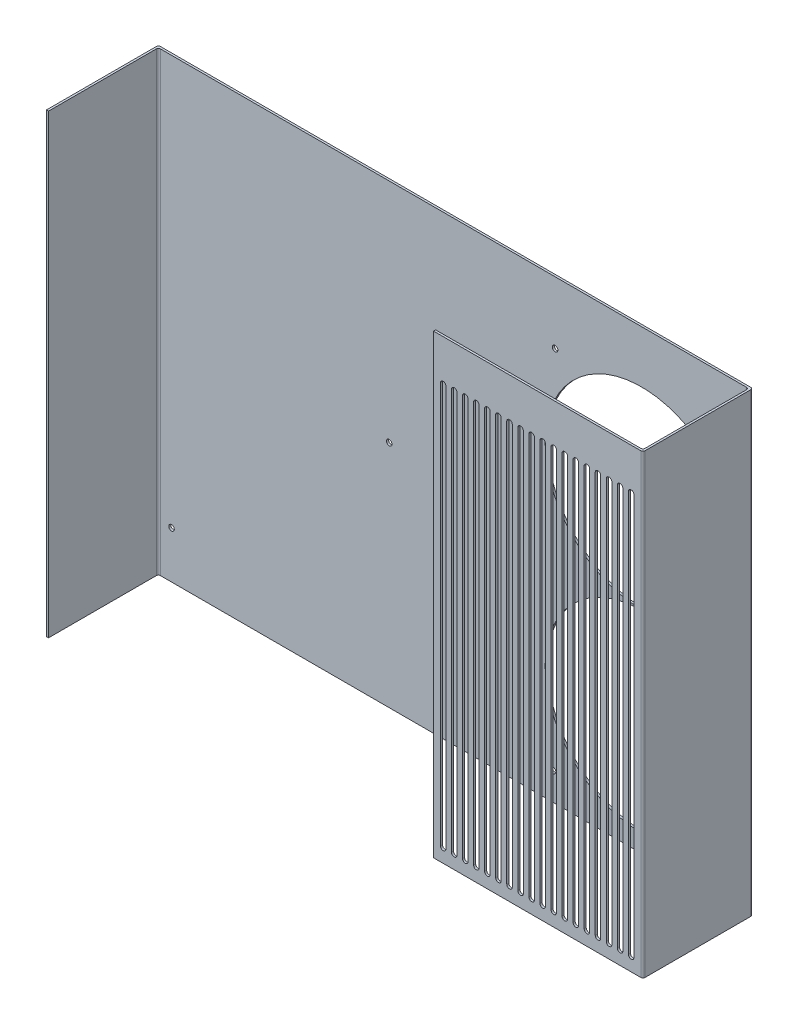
from build123d import *

# Parameters (mm, degrees)
ESQUISSE1_W             = 430
ESQUISSE1_H             = 330
BOSS_EXTRU_1_DEPTH      = 1.5
ESQUISSE2_W             = 1.5
ESQUISSE2_H             = 330
BOSS_EXTRU_2_DEPTH      = 79.5
ESQUISSE3_W             = 1.5
ESQUISSE3_H             = 330
BOSS_EXTRU_3_DEPTH      = 78
ESQUISSE4_W             = 1.5
ESQUISSE4_H             = 330
BOSS_EXTRU_4_DEPTH      = 150
CONG_1_R                = 1.5
ESQUISSE6_R             = 2
ENL_V_MAT_EXTRU_1_DEPTH = 3
ESQUISSE7_R             = 2
ESQUISSE7_R_2           = 69.75
ENL_V_MAT_EXTRU_2_DEPTH = 3
ENL_V_MAT_EXTRU_3_DEPTH = 3


with BuildPart() as part:
    # Esquisse1 → Boss.-Extru.1 (new body)
    with BuildSketch(Plane.XY):
        with Locations((-38.017202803, -7.151182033)):
            Rectangle(ESQUISSE1_W, ESQUISSE1_H)
    extrude(amount=BOSS_EXTRU_1_DEPTH)

    # Esquisse2 → Boss.-Extru.2 (add)
    with BuildSketch(Plane.XY.offset(1.5)):
        with Locations((-252.267202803, -7.151182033)):
            Rectangle(ESQUISSE2_W, ESQUISSE2_H)
    extrude(amount=BOSS_EXTRU_2_DEPTH)

    # Esquisse3 → Boss.-Extru.3 (add)
    with BuildSketch(Plane.XY.offset(1.5)):
        with Locations((176.232797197, -7.151182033)):
            Rectangle(ESQUISSE3_W, ESQUISSE3_H)
    extrude(amount=BOSS_EXTRU_3_DEPTH)

    # Esquisse4 → Boss.-Extru.4 (add)
    with BuildSketch(Plane.ZY.offset(-175.482797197)):
        with Locations((78.75, -7.151182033)):
            Rectangle(ESQUISSE4_W, ESQUISSE4_H)
    extrude(amount=BOSS_EXTRU_4_DEPTH)

    # Cong_1
    cong_1_edges = [part.edges().sort_by_distance(p)[0] for p in [
        (-251.517202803, -7.151182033, 1.5),
        (175.482797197, -7.151182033, 1.5),
        (176.982797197, -7.151182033, 79.5),
        (175.482797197, -7.151182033, 78),
        (176.982797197, -7.151182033, 0),
        (-253.017202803, -7.151182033, 0),
    ]]
    fillet(cong_1_edges, radius=CONG_1_R)

    # Esquisse6 → Enl_v. mat.-Extru.1 (cut)
    with BuildSketch(Plane.XY.offset(1.5)):
        with Locations((-242.017202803, -138.151182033)):
            Circle(ESQUISSE6_R)
        with Locations((-84.537202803, -6.071182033)):
            Circle(ESQUISSE6_R)
    extrude(amount=-ENL_V_MAT_EXTRU_1_DEPTH, mode=Mode.SUBTRACT)

    # Esquisse7 → Enl_v. mat.-Extru.2 (cut)
    with BuildSketch(Plane(origin=(0, 0, 0), x_dir=(-1, 0, 0), z_dir=(0, 0, -1))):
        with Locations((-160.482797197, -152.151182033)):
            Circle(ESQUISSE7_R)
        with Locations((-35.482797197, 112.848817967)):
            Circle(ESQUISSE7_R)
        with Locations((-160.482797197, 112.848817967)):
            Circle(ESQUISSE7_R)
        with Locations((-33.982821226, -152.146936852)):
            Circle(ESQUISSE7_R)
        with Locations((-97.982797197, 50.348817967)):
            Circle(ESQUISSE7_R_2)
        with Locations((-97.982797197, -89.646936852)):
            Circle(ESQUISSE7_R_2)
    extrude(amount=-ENL_V_MAT_EXTRU_2_DEPTH, mode=Mode.SUBTRACT)

    # Esquisse9 → Enl_v. mat.-Extru.3 (cut)
    with BuildSketch(Plane.XY.offset(79.5)):
        with BuildLine():
            Line((170.482797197, -162.151182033), (170.482797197, 127.848817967))
            ThreePointArc((170.482797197, 127.848817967), (168.482797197, 129.848817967), (166.482797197, 127.848817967))
            Line((166.482797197, 127.848817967), (166.482797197, -162.151182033))
            ThreePointArc((166.482797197, -162.151182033), (168.482797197, -164.151182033), (170.482797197, -162.151182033))
        make_face()
        with BuildLine():
            Line((162.482797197, -162.151182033), (162.482797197, 127.848817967))
            ThreePointArc((162.482797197, 127.848817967), (160.482797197, 129.848817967), (158.482797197, 127.848817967))
            Line((158.482797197, 127.848817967), (158.482797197, -162.151182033))
            ThreePointArc((158.482797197, -162.151182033), (160.482797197, -164.151182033), (162.482797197, -162.151182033))
        make_face()
        with BuildLine():
            Line((154.482797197, -162.151182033), (154.482797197, 127.848817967))
            ThreePointArc((154.482797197, 127.848817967), (152.482797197, 129.848817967), (150.482797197, 127.848817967))
            Line((150.482797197, 127.848817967), (150.482797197, -162.151182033))
            ThreePointArc((150.482797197, -162.151182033), (152.482797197, -164.151182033), (154.482797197, -162.151182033))
        make_face()
        with BuildLine():
            Line((146.482797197, -162.151182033), (146.482797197, 127.848817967))
            ThreePointArc((146.482797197, 127.848817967), (144.482797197, 129.848817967), (142.482797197, 127.848817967))
            Line((142.482797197, 127.848817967), (142.482797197, -162.151182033))
            ThreePointArc((142.482797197, -162.151182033), (144.482797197, -164.151182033), (146.482797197, -162.151182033))
        make_face()
        with BuildLine():
            Line((138.482797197, -162.151182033), (138.482797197, 127.848817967))
            ThreePointArc((138.482797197, 127.848817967), (136.482797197, 129.848817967), (134.482797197, 127.848817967))
            Line((134.482797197, 127.848817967), (134.482797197, -162.151182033))
            ThreePointArc((134.482797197, -162.151182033), (136.482797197, -164.151182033), (138.482797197, -162.151182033))
        make_face()
        with BuildLine():
            Line((130.482797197, -162.151182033), (130.482797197, 127.848817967))
            ThreePointArc((130.482797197, 127.848817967), (128.482797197, 129.848817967), (126.482797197, 127.848817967))
            Line((126.482797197, 127.848817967), (126.482797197, -162.151182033))
            ThreePointArc((126.482797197, -162.151182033), (128.482797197, -164.151182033), (130.482797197, -162.151182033))
        make_face()
        with BuildLine():
            Line((122.482797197, -162.151182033), (122.482797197, 127.848817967))
            ThreePointArc((122.482797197, 127.848817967), (120.482797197, 129.848817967), (118.482797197, 127.848817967))
            Line((118.482797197, 127.848817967), (118.482797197, -162.151182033))
            ThreePointArc((118.482797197, -162.151182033), (120.482797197, -164.151182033), (122.482797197, -162.151182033))
        make_face()
        with BuildLine():
            Line((114.482797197, -162.151182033), (114.482797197, 127.848817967))
            ThreePointArc((114.482797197, 127.848817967), (112.482797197, 129.848817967), (110.482797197, 127.848817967))
            Line((110.482797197, 127.848817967), (110.482797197, -162.151182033))
            ThreePointArc((110.482797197, -162.151182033), (112.482797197, -164.151182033), (114.482797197, -162.151182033))
        make_face()
        with BuildLine():
            Line((106.482797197, -162.151182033), (106.482797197, 127.848817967))
            ThreePointArc((106.482797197, 127.848817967), (104.482797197, 129.848817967), (102.482797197, 127.848817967))
            Line((102.482797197, 127.848817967), (102.482797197, -162.151182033))
            ThreePointArc((102.482797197, -162.151182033), (104.482797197, -164.151182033), (106.482797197, -162.151182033))
        make_face()
        with BuildLine():
            Line((98.482797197, -162.151182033), (98.482797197, 127.848817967))
            ThreePointArc((98.482797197, 127.848817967), (96.482797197, 129.848817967), (94.482797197, 127.848817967))
            Line((94.482797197, 127.848817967), (94.482797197, -162.151182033))
            ThreePointArc((94.482797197, -162.151182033), (96.482797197, -164.151182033), (98.482797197, -162.151182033))
        make_face()
        with BuildLine():
            Line((90.482797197, -162.151182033), (90.482797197, 127.848817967))
            ThreePointArc((90.482797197, 127.848817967), (88.482797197, 129.848817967), (86.482797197, 127.848817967))
            Line((86.482797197, 127.848817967), (86.482797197, -162.151182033))
            ThreePointArc((86.482797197, -162.151182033), (88.482797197, -164.151182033), (90.482797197, -162.151182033))
        make_face()
        with BuildLine():
            Line((82.482797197, -162.151182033), (82.482797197, 127.848817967))
            ThreePointArc((82.482797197, 127.848817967), (80.482797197, 129.848817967), (78.482797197, 127.848817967))
            Line((78.482797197, 127.848817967), (78.482797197, -162.151182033))
            ThreePointArc((78.482797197, -162.151182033), (80.482797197, -164.151182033), (82.482797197, -162.151182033))
        make_face()
        with BuildLine():
            Line((74.482797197, -162.151182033), (74.482797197, 127.848817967))
            ThreePointArc((74.482797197, 127.848817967), (72.482797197, 129.848817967), (70.482797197, 127.848817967))
            Line((70.482797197, 127.848817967), (70.482797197, -162.151182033))
            ThreePointArc((70.482797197, -162.151182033), (72.482797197, -164.151182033), (74.482797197, -162.151182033))
        make_face()
        with BuildLine():
            Line((66.482797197, -162.151182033), (66.482797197, 127.848817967))
            ThreePointArc((66.482797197, 127.848817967), (64.482797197, 129.848817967), (62.482797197, 127.848817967))
            Line((62.482797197, 127.848817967), (62.482797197, -162.151182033))
            ThreePointArc((62.482797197, -162.151182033), (64.482797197, -164.151182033), (66.482797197, -162.151182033))
        make_face()
        with BuildLine():
            Line((58.482797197, -162.151182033), (58.482797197, 127.848817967))
            ThreePointArc((58.482797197, 127.848817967), (56.482797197, 129.848817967), (54.482797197, 127.848817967))
            Line((54.482797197, 127.848817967), (54.482797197, -162.151182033))
            ThreePointArc((54.482797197, -162.151182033), (56.482797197, -164.151182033), (58.482797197, -162.151182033))
        make_face()
        with BuildLine():
            Line((50.482797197, -162.151182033), (50.482797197, 127.848817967))
            ThreePointArc((50.482797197, 127.848817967), (48.482797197, 129.848817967), (46.482797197, 127.848817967))
            Line((46.482797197, 127.848817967), (46.482797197, -162.151182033))
            ThreePointArc((46.482797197, -162.151182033), (48.482797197, -164.151182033), (50.482797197, -162.151182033))
        make_face()
        with BuildLine():
            Line((42.482797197, -162.151182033), (42.482797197, 127.848817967))
            ThreePointArc((42.482797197, 127.848817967), (40.482797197, 129.848817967), (38.482797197, 127.848817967))
            Line((38.482797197, 127.848817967), (38.482797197, -162.151182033))
            ThreePointArc((38.482797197, -162.151182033), (40.482797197, -164.151182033), (42.482797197, -162.151182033))
        make_face()
        with BuildLine():
            Line((34.482797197, -162.151182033), (34.482797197, 127.848817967))
            ThreePointArc((34.482797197, 127.848817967), (32.482797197, 129.848817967), (30.482797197, 127.848817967))
            Line((30.482797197, 127.848817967), (30.482797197, -162.151182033))
            ThreePointArc((30.482797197, -162.151182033), (32.482797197, -164.151182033), (34.482797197, -162.151182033))
        make_face()
    extrude(amount=-ENL_V_MAT_EXTRU_3_DEPTH, mode=Mode.SUBTRACT)


solid = part.part
